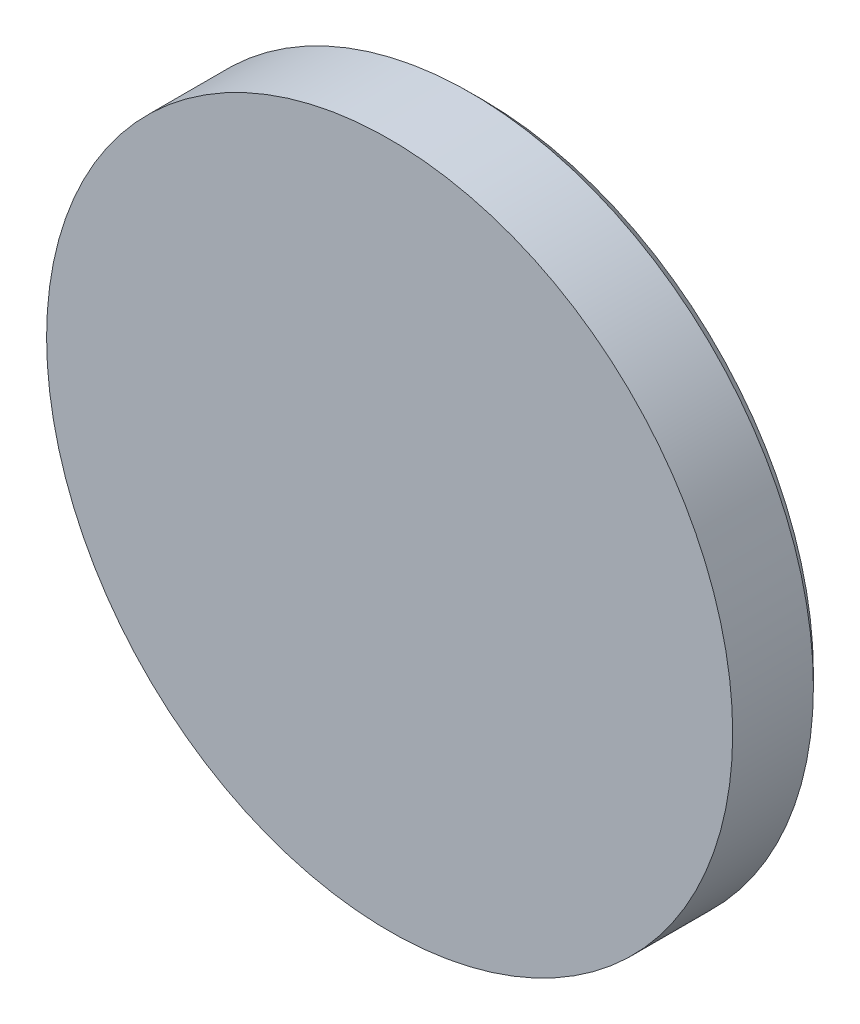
ISO-10303-21;
HEADER;
FILE_DESCRIPTION(('STEP AP214'),'2;1');
FILE_NAME('part.step','',(''),(''),'','','');
FILE_SCHEMA(('AUTOMOTIVE_DESIGN { 1 0 10303 214 1 1 1 1 }'));
ENDSEC;
DATA;
#1=APPLICATION_CONTEXT('core data for automotive mechanical design processes');
#2=APPLICATION_PROTOCOL_DEFINITION('international standard','automotive_design',2000,#1);
#3=PRODUCT_CONTEXT('',#1,'mechanical');
#4=PRODUCT('Part','Part','',(#3));
#5=PRODUCT_RELATED_PRODUCT_CATEGORY('part','',(#4));
#6=PRODUCT_DEFINITION_FORMATION('','',#4);
#7=PRODUCT_DEFINITION_CONTEXT('part definition',#1,'design');
#8=PRODUCT_DEFINITION('design','',#6,#7);
#9=PRODUCT_DEFINITION_SHAPE('','',#8);
#10=(LENGTH_UNIT() NAMED_UNIT(*) SI_UNIT(.MILLI.,.METRE.));
#11=(NAMED_UNIT(*) PLANE_ANGLE_UNIT() SI_UNIT($,.RADIAN.));
#12=(NAMED_UNIT(*) SI_UNIT($,.STERADIAN.) SOLID_ANGLE_UNIT());
#13=UNCERTAINTY_MEASURE_WITH_UNIT(LENGTH_MEASURE(1.E-05),#10,'distance_accuracy_value','');
#14=(GEOMETRIC_REPRESENTATION_CONTEXT(3) GLOBAL_UNCERTAINTY_ASSIGNED_CONTEXT((#13)) GLOBAL_UNIT_ASSIGNED_CONTEXT((#10,
#11,#12)) REPRESENTATION_CONTEXT('',''));
#15=CARTESIAN_POINT('',(0.,0.,0.));
#16=DIRECTION('',(0.,0.,1.));
#17=DIRECTION('',(1.,0.,0.));
#18=AXIS2_PLACEMENT_3D('',#15,#16,#17);
#19=CARTESIAN_POINT('',(0.,0.,25.));
#20=DIRECTION('',(0.,0.,-1.));
#21=DIRECTION('',(-1.,0.,0.));
#22=AXIS2_PLACEMENT_3D('',#19,#20,#21);
#23=CYLINDRICAL_SURFACE('',#22,85.);
#24=CARTESIAN_POINT('',(0.,0.,4.99999999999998));
#25=DIRECTION('',(0.,0.,-1.));
#26=DIRECTION('',(-1.,0.,0.));
#27=AXIS2_PLACEMENT_3D('',#24,#25,#26);
#28=CIRCLE('',#27,85.);
#29=CARTESIAN_POINT('',(85.,0.,4.99999999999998));
#30=VERTEX_POINT('',#29);
#31=EDGE_CURVE('E11',#30,#30,#28,.F.);
#32=ORIENTED_EDGE('',*,*,#31,.T.);
#33=EDGE_LOOP('',(#32));
#34=FACE_BOUND('',#33,.T.);
#35=CARTESIAN_POINT('',(0.,0.,25.));
#36=DIRECTION('',(0.,0.,1.));
#37=DIRECTION('',(1.,0.,0.));
#38=AXIS2_PLACEMENT_3D('',#35,#36,#37);
#39=CIRCLE('',#38,85.);
#40=CARTESIAN_POINT('',(85.,0.,25.));
#41=VERTEX_POINT('',#40);
#42=EDGE_CURVE('E42',#41,#41,#39,.T.);
#43=ORIENTED_EDGE('',*,*,#42,.F.);
#44=EDGE_LOOP('',(#43));
#45=FACE_BOUND('',#44,.T.);
#46=ADVANCED_FACE('F31',(#34,#45),#23,.T.);
#47=CARTESIAN_POINT('',(0.,0.,25.));
#48=DIRECTION('',(0.,0.,1.));
#49=DIRECTION('',(1.,0.,0.));
#50=AXIS2_PLACEMENT_3D('',#47,#48,#49);
#51=PLANE('',#50);
#52=ORIENTED_EDGE('',*,*,#42,.T.);
#53=EDGE_LOOP('',(#52));
#54=FACE_BOUND('',#53,.T.);
#55=ADVANCED_FACE('F60',(#54),#51,.T.);
#56=CARTESIAN_POINT('',(0.,0.,2.));
#57=DIRECTION('',(0.,0.,-1.));
#58=DIRECTION('',(-1.,0.,0.));
#59=AXIS2_PLACEMENT_3D('',#56,#57,#58);
#60=PLANE('',#59);
#61=CARTESIAN_POINT('',(0.,0.,2.));
#62=DIRECTION('',(0.,0.,-1.));
#63=DIRECTION('',(-1.,0.,0.));
#64=AXIS2_PLACEMENT_3D('',#61,#62,#63);
#65=CIRCLE('',#64,82.0000000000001);
#66=CARTESIAN_POINT('',(82.0000000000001,0.,2.));
#67=VERTEX_POINT('',#66);
#68=EDGE_CURVE('E38',#67,#67,#65,.T.);
#69=ORIENTED_EDGE('',*,*,#68,.T.);
#70=EDGE_LOOP('',(#69));
#71=FACE_BOUND('',#70,.T.);
#72=CARTESIAN_POINT('',(0.,0.,2.));
#73=DIRECTION('',(0.,0.,-1.));
#74=DIRECTION('',(-1.,0.,0.));
#75=AXIS2_PLACEMENT_3D('',#72,#73,#74);
#76=CIRCLE('',#75,74.);
#77=CARTESIAN_POINT('',(-74.,0.,2.));
#78=VERTEX_POINT('',#77);
#79=EDGE_CURVE('E46',#78,#78,#76,.T.);
#80=ORIENTED_EDGE('',*,*,#79,.F.);
#81=EDGE_LOOP('',(#80));
#82=FACE_BOUND('',#81,.T.);
#83=ADVANCED_FACE('F58',(#71,#82),#60,.T.);
#84=CARTESIAN_POINT('',(0.,0.,2.));
#85=DIRECTION('',(0.,0.,-1.));
#86=DIRECTION('',(-1.,0.,0.));
#87=AXIS2_PLACEMENT_3D('',#84,#85,#86);
#88=CYLINDRICAL_SURFACE('',#87,74.);
#89=ORIENTED_EDGE('',*,*,#79,.T.);
#90=EDGE_LOOP('',(#89));
#91=FACE_BOUND('',#90,.T.);
#92=CARTESIAN_POINT('',(0.,0.,0.));
#93=DIRECTION('',(0.,0.,-1.));
#94=DIRECTION('',(-1.,0.,0.));
#95=AXIS2_PLACEMENT_3D('',#92,#93,#94);
#96=CIRCLE('',#95,74.);
#97=CARTESIAN_POINT('',(-74.,0.,0.));
#98=VERTEX_POINT('',#97);
#99=EDGE_CURVE('E49',#98,#98,#96,.T.);
#100=ORIENTED_EDGE('',*,*,#99,.F.);
#101=EDGE_LOOP('',(#100));
#102=FACE_BOUND('',#101,.T.);
#103=ADVANCED_FACE('F55',(#91,#102),#88,.T.);
#104=CARTESIAN_POINT('',(0.,0.,0.));
#105=DIRECTION('',(0.,0.,1.));
#106=DIRECTION('',(1.,0.,0.));
#107=AXIS2_PLACEMENT_3D('',#104,#105,#106);
#108=PLANE('',#107);
#109=ORIENTED_EDGE('',*,*,#99,.T.);
#110=EDGE_LOOP('',(#109));
#111=FACE_BOUND('',#110,.T.);
#112=ADVANCED_FACE('F66',(#111),#108,.F.);
#113=CARTESIAN_POINT('',(0.,0.,2.));
#114=DIRECTION('',(0.,0.,1.));
#115=DIRECTION('',(1.,0.,0.));
#116=AXIS2_PLACEMENT_3D('',#113,#114,#115);
#117=CONICAL_SURFACE('',#116,82.0000000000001,0.785398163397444);
#118=CARTESIAN_POINT('',(85.,0.,4.99999999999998));
#119=CARTESIAN_POINT('',(84.96875,0.,4.96874999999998));
#120=CARTESIAN_POINT('',(84.9375,0.,4.93749999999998));
#121=CARTESIAN_POINT('',(84.875,0.,4.87499999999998));
#122=CARTESIAN_POINT('',(84.84375,0.,4.84374999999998));
#123=CARTESIAN_POINT('',(84.78125,0.,4.78124999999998));
#124=CARTESIAN_POINT('',(84.75,0.,4.74999999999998));
#125=CARTESIAN_POINT('',(84.6875,0.,4.68749999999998));
#126=CARTESIAN_POINT('',(84.65625,0.,4.65624999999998));
#127=CARTESIAN_POINT('',(84.59375,0.,4.59374999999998));
#128=CARTESIAN_POINT('',(84.5625,0.,4.56249999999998));
#129=CARTESIAN_POINT('',(84.5,0.,4.49999999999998));
#130=CARTESIAN_POINT('',(84.46875,0.,4.46874999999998));
#131=CARTESIAN_POINT('',(84.40625,0.,4.40624999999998));
#132=CARTESIAN_POINT('',(84.375,0.,4.37499999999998));
#133=CARTESIAN_POINT('',(84.3125,0.,4.31249999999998));
#134=CARTESIAN_POINT('',(84.28125,0.,4.28124999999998));
#135=CARTESIAN_POINT('',(84.21875,0.,4.21874999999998));
#136=CARTESIAN_POINT('',(84.1875,0.,4.18749999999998));
#137=CARTESIAN_POINT('',(84.125,0.,4.12499999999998));
#138=CARTESIAN_POINT('',(84.09375,0.,4.09374999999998));
#139=CARTESIAN_POINT('',(84.03125,0.,4.03124999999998));
#140=CARTESIAN_POINT('',(84.,0.,3.99999999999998));
#141=CARTESIAN_POINT('',(83.9375,0.,3.93749999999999));
#142=CARTESIAN_POINT('',(83.90625,0.,3.90624999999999));
#143=CARTESIAN_POINT('',(83.84375,0.,3.84374999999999));
#144=CARTESIAN_POINT('',(83.8125,0.,3.81249999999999));
#145=CARTESIAN_POINT('',(83.75,0.,3.74999999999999));
#146=CARTESIAN_POINT('',(83.71875,0.,3.71874999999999));
#147=CARTESIAN_POINT('',(83.65625,0.,3.65624999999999));
#148=CARTESIAN_POINT('',(83.625,0.,3.62499999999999));
#149=CARTESIAN_POINT('',(83.5625000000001,0.,3.56249999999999));
#150=CARTESIAN_POINT('',(83.53125,0.,3.53124999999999));
#151=CARTESIAN_POINT('',(83.4687500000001,0.,3.46874999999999));
#152=CARTESIAN_POINT('',(83.4375,0.,3.43749999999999));
#153=CARTESIAN_POINT('',(83.375,0.,3.37499999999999));
#154=CARTESIAN_POINT('',(83.3437500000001,0.,3.34374999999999));
#155=CARTESIAN_POINT('',(83.2812500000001,0.,3.28124999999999));
#156=CARTESIAN_POINT('',(83.25,0.,3.24999999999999));
#157=CARTESIAN_POINT('',(83.1875000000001,0.,3.18749999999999));
#158=CARTESIAN_POINT('',(83.15625,0.,3.15624999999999));
#159=CARTESIAN_POINT('',(83.09375,0.,3.09374999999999));
#160=CARTESIAN_POINT('',(83.0625000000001,0.,3.06249999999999));
#161=CARTESIAN_POINT('',(83.0000000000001,0.,2.99999999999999));
#162=CARTESIAN_POINT('',(82.96875,0.,2.96874999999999));
#163=CARTESIAN_POINT('',(82.9062500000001,0.,2.90624999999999));
#164=CARTESIAN_POINT('',(82.8750000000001,0.,2.87499999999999));
#165=CARTESIAN_POINT('',(82.8125000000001,0.,2.81249999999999));
#166=CARTESIAN_POINT('',(82.7812500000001,0.,2.78124999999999));
#167=CARTESIAN_POINT('',(82.7187500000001,0.,2.71875));
#168=CARTESIAN_POINT('',(82.6875000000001,0.,2.6875));
#169=CARTESIAN_POINT('',(82.6250000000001,0.,2.625));
#170=CARTESIAN_POINT('',(82.5937500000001,0.,2.59375));
#171=CARTESIAN_POINT('',(82.5312500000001,0.,2.53124999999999));
#172=CARTESIAN_POINT('',(82.5000000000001,0.,2.5));
#173=CARTESIAN_POINT('',(82.4375000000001,0.,2.4375));
#174=CARTESIAN_POINT('',(82.4062500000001,0.,2.40625));
#175=CARTESIAN_POINT('',(82.3437500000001,0.,2.34375));
#176=CARTESIAN_POINT('',(82.3125000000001,0.,2.3125));
#177=CARTESIAN_POINT('',(82.2500000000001,0.,2.25));
#178=CARTESIAN_POINT('',(82.2187500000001,0.,2.21875));
#179=CARTESIAN_POINT('',(82.1562500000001,0.,2.15625));
#180=CARTESIAN_POINT('',(82.1250000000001,0.,2.125));
#181=CARTESIAN_POINT('',(82.0625000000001,0.,2.0625));
#182=CARTESIAN_POINT('',(82.0312500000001,0.,2.03125));
#183=CARTESIAN_POINT('',(82.0000000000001,0.,2.));
#184=B_SPLINE_CURVE_WITH_KNOTS('',3,(#118,#119,#120,#121,#122,#123,#124,#125,#126,#127,#128,
#129,#130,#131,#132,#133,#134,#135,#136,#137,#138,#139,#140,#141,#142,#143,#144,#145,#146,#147,
#148,#149,#150,#151,#152,#153,#154,#155,#156,#157,#158,#159,#160,#161,#162,#163,#164,#165,#166,
#167,#168,#169,#170,#171,#172,#173,#174,#175,#176,#177,#178,#179,#180,#181,#182,#183),
.UNSPECIFIED.,.F.,.F.,(4,2,2,2,2,2,2,2,2,2,2,2,2,2,2,2,2,2,2,2,2,2,2,2,2,2,2,2,2,2,2,2,4),(0.,
0.132582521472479,0.265165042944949,0.397747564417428,0.530330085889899,0.662912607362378,
0.795495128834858,0.928077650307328,1.06066017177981,1.19324269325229,1.32582521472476,
1.45840773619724,1.59099025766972,1.72357277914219,1.85615530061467,1.98873782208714,
2.12132034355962,2.25390286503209,2.38648538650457,2.51906790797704,2.65165042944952,
2.78423295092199,2.91681547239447,3.04939799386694,3.18198051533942,3.3145630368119,
3.44714555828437,3.57972807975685,3.71231060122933,3.8448931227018,3.97747564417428,
4.11005816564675,4.24264068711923),.UNSPECIFIED.);
#185=EDGE_CURVE('BSEAM33',#30,#67,#184,.T.);
#186=ORIENTED_EDGE('',*,*,#31,.F.);
#187=ORIENTED_EDGE('',*,*,#68,.F.);
#188=ORIENTED_EDGE('',*,*,#185,.T.);
#189=ORIENTED_EDGE('',*,*,#185,.F.);
#190=EDGE_LOOP('',(#186,#188,#187,#189));
#191=FACE_BOUND('',#190,.T.);
#192=ADVANCED_FACE('F33',(#191),#117,.T.);
#193=CLOSED_SHELL('',(#46,#55,#83,#103,#112,#192));
#194=MANIFOLD_SOLID_BREP('B2',#193);
#195=ADVANCED_BREP_SHAPE_REPRESENTATION('',(#18,#194),#14);
#196=SHAPE_DEFINITION_REPRESENTATION(#9,#195);
ENDSEC;
END-ISO-10303-21;
